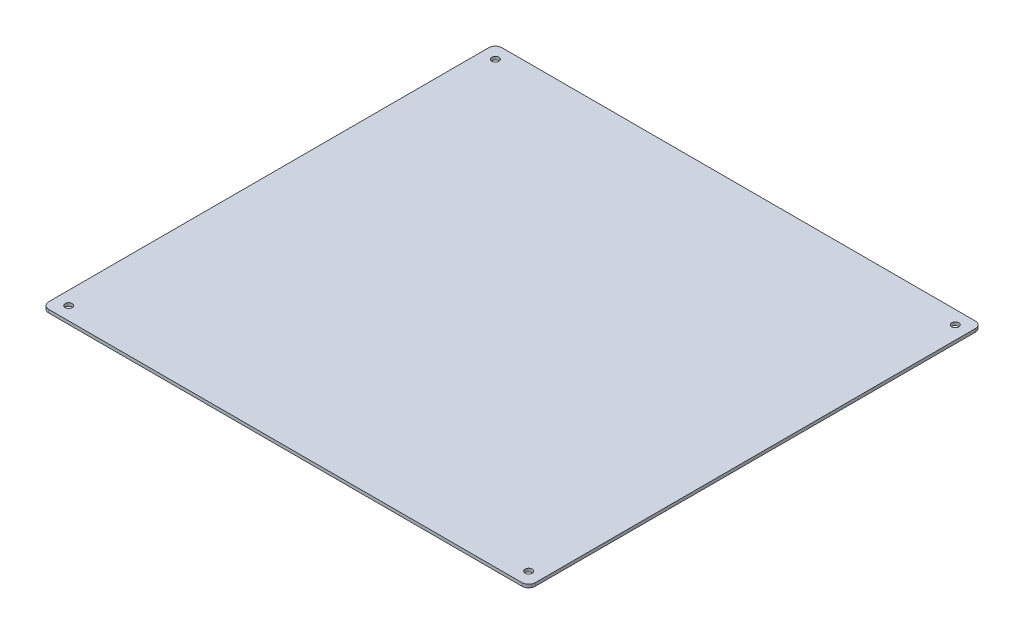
from build123d import *

# Parameters (mm, degrees)
SKETCH3_W                        = 463.55
SKETCH3_H                        = 431.8
BOSS_EXTRUDE1_DEPTH              = 2.9972
F_17_64_0_26563_DIAMETER_HOLE1_D = 6.747002
FILLET1_R                        = 6.35


with BuildPart() as part:
    # Sketch3 → Boss-Extrude1 (new body)
    with BuildSketch(Plane(origin=(0, 0, 0), x_dir=(1, 0, 0), z_dir=(0, 1, 0))):
        Rectangle(SKETCH3_W, SKETCH3_H)
    extrude(amount=BOSS_EXTRUDE1_DEPTH)

    # 17_64 _0.26563_ Diameter Hole1 (through all)
    with Locations(Plane(origin=(0, 2.9972, 0), x_dir=(1, 0, 0), z_dir=(0, 1, 0))):
        with Locations((-219.075, 203.2), (-219.075, -203.2), (219.075, -203.2), (219.075, 203.2)):
            Hole(F_17_64_0_26563_DIAMETER_HOLE1_D / 2)

    # Fillet1
    fillet1_edges = [part.edges().sort_by_distance(p)[0] for p in [
        (231.775, 1.4986, 215.9),
        (-231.775, 1.4986, 215.9),
        (-231.775, 1.4986, -215.9),
        (231.775, 1.4986, -215.9),
    ]]
    fillet(fillet1_edges, radius=FILLET1_R)


solid = part.part
